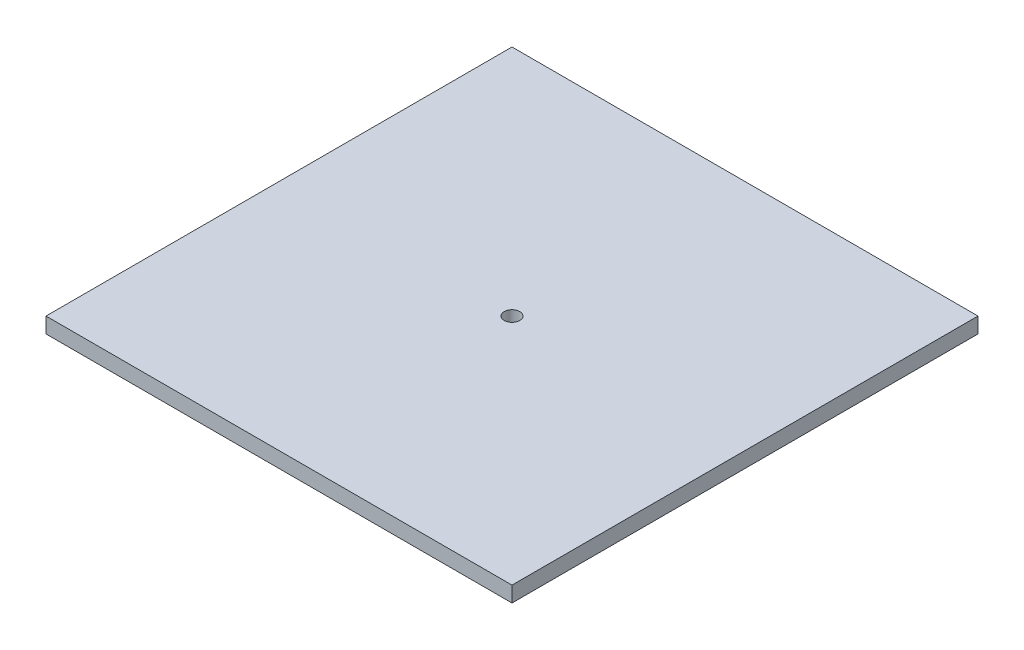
from build123d import *

# Parameters (mm, degrees)
ESQUISSE1_W      = 180
ESQUISSE1_H      = 180
ESQUISSE1_R      = 3
EXTRUSION1_DEPTH = 6


with BuildPart() as part:
    # Esquisse1 → Extrusion1 (new body)
    with BuildSketch(Plane(origin=(0, 0, 0), x_dir=(1, 0, 0), z_dir=(0, 1, 0))):
        with Locations((90, 90)):
            Rectangle(ESQUISSE1_W, ESQUISSE1_H)
        with Locations(Location((90, 90, 0), (0, 0, 270))):
            Circle(ESQUISSE1_R, mode=Mode.SUBTRACT)
    extrude(amount=EXTRUSION1_DEPTH)


solid = part.part
